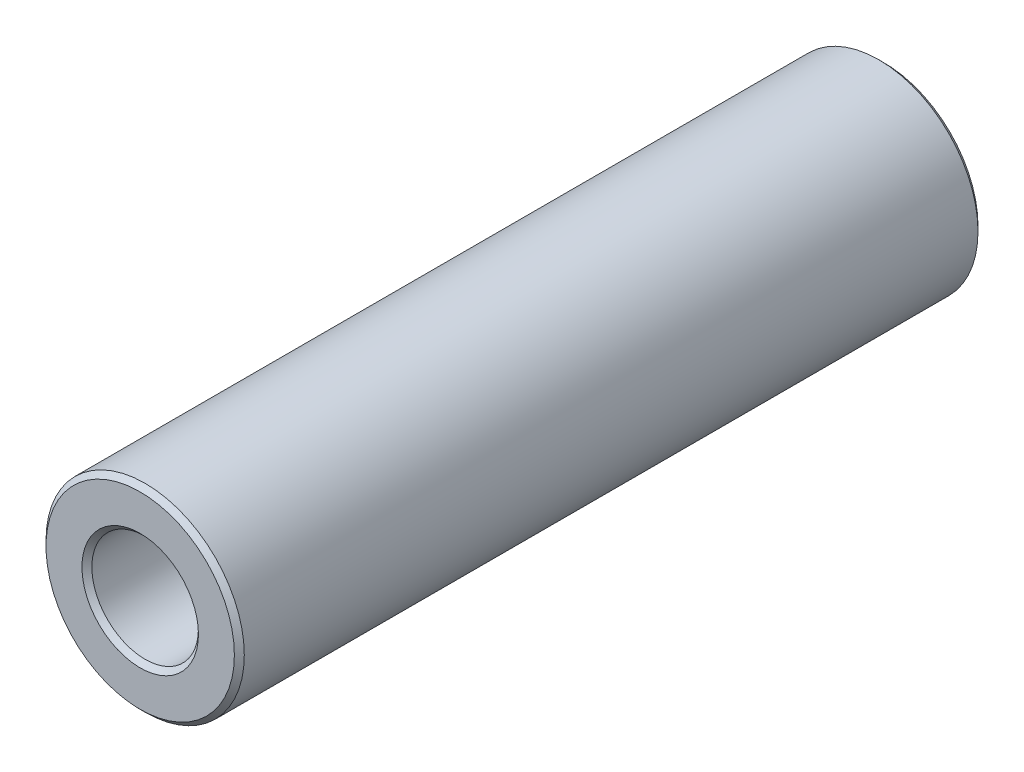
ISO-10303-21;
HEADER;
FILE_DESCRIPTION(('STEP AP214'),'2;1');
FILE_NAME('part.step','',(''),(''),'','','');
FILE_SCHEMA(('AUTOMOTIVE_DESIGN { 1 0 10303 214 1 1 1 1 }'));
ENDSEC;
DATA;
#1=APPLICATION_CONTEXT('core data for automotive mechanical design processes');
#2=APPLICATION_PROTOCOL_DEFINITION('international standard','automotive_design',2000,#1);
#3=PRODUCT_CONTEXT('',#1,'mechanical');
#4=PRODUCT('Part','Part','',(#3));
#5=PRODUCT_RELATED_PRODUCT_CATEGORY('part','',(#4));
#6=PRODUCT_DEFINITION_FORMATION('','',#4);
#7=PRODUCT_DEFINITION_CONTEXT('part definition',#1,'design');
#8=PRODUCT_DEFINITION('design','',#6,#7);
#9=PRODUCT_DEFINITION_SHAPE('','',#8);
#10=(LENGTH_UNIT() NAMED_UNIT(*) SI_UNIT(.MILLI.,.METRE.));
#11=(NAMED_UNIT(*) PLANE_ANGLE_UNIT() SI_UNIT($,.RADIAN.));
#12=(NAMED_UNIT(*) SI_UNIT($,.STERADIAN.) SOLID_ANGLE_UNIT());
#13=UNCERTAINTY_MEASURE_WITH_UNIT(LENGTH_MEASURE(1.E-05),#10,'distance_accuracy_value','');
#14=(GEOMETRIC_REPRESENTATION_CONTEXT(3) GLOBAL_UNCERTAINTY_ASSIGNED_CONTEXT((#13)) GLOBAL_UNIT_ASSIGNED_CONTEXT((#10,
#11,#12)) REPRESENTATION_CONTEXT('',''));
#15=CARTESIAN_POINT('',(0.,0.,0.));
#16=DIRECTION('',(0.,0.,1.));
#17=DIRECTION('',(1.,0.,0.));
#18=AXIS2_PLACEMENT_3D('',#15,#16,#17);
#19=CARTESIAN_POINT('',(0.,0.,15.));
#20=DIRECTION('',(0.,0.,1.));
#21=DIRECTION('',(1.,0.,0.));
#22=AXIS2_PLACEMENT_3D('',#19,#20,#21);
#23=PLANE('',#22);
#24=CARTESIAN_POINT('',(0.,0.,15.));
#25=DIRECTION('',(0.,0.,1.));
#26=DIRECTION('',(1.,0.,0.));
#27=AXIS2_PLACEMENT_3D('',#24,#25,#26);
#28=CIRCLE('',#27,2.35);
#29=CARTESIAN_POINT('',(2.35,0.,15.));
#30=VERTEX_POINT('',#29);
#31=EDGE_CURVE('E10',#30,#30,#28,.F.);
#32=ORIENTED_EDGE('',*,*,#31,.T.);
#33=EDGE_LOOP('',(#32));
#34=FACE_BOUND('',#33,.T.);
#35=CARTESIAN_POINT('',(0.,0.,15.));
#36=DIRECTION('',(0.,0.,1.));
#37=DIRECTION('',(1.,0.,0.));
#38=AXIS2_PLACEMENT_3D('',#35,#36,#37);
#39=CIRCLE('',#38,3.79999999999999);
#40=CARTESIAN_POINT('',(3.79999999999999,0.,15.));
#41=VERTEX_POINT('',#40);
#42=EDGE_CURVE('E45',#41,#41,#39,.T.);
#43=ORIENTED_EDGE('',*,*,#42,.T.);
#44=EDGE_LOOP('',(#43));
#45=FACE_BOUND('',#44,.T.);
#46=ADVANCED_FACE('F37',(#34,#45),#23,.T.);
#47=CARTESIAN_POINT('',(0.,0.,-15.));
#48=DIRECTION('',(0.,0.,1.));
#49=DIRECTION('',(1.,0.,0.));
#50=AXIS2_PLACEMENT_3D('',#47,#48,#49);
#51=PLANE('',#50);
#52=CARTESIAN_POINT('',(0.,0.,-15.));
#53=DIRECTION('',(0.,0.,1.));
#54=DIRECTION('',(1.,0.,0.));
#55=AXIS2_PLACEMENT_3D('',#52,#53,#54);
#56=CIRCLE('',#55,3.79999999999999);
#57=CARTESIAN_POINT('',(3.79999999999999,0.,-15.));
#58=VERTEX_POINT('',#57);
#59=EDGE_CURVE('E62',#58,#58,#56,.F.);
#60=ORIENTED_EDGE('',*,*,#59,.T.);
#61=EDGE_LOOP('',(#60));
#62=FACE_BOUND('',#61,.T.);
#63=CARTESIAN_POINT('',(0.,0.,-15.));
#64=DIRECTION('',(0.,0.,1.));
#65=DIRECTION('',(1.,0.,0.));
#66=AXIS2_PLACEMENT_3D('',#63,#64,#65);
#67=CIRCLE('',#66,2.35);
#68=CARTESIAN_POINT('',(2.35,0.,-15.));
#69=VERTEX_POINT('',#68);
#70=EDGE_CURVE('E66',#69,#69,#67,.T.);
#71=ORIENTED_EDGE('',*,*,#70,.T.);
#72=EDGE_LOOP('',(#71));
#73=FACE_BOUND('',#72,.T.);
#74=ADVANCED_FACE('F89',(#62,#73),#51,.F.);
#75=CARTESIAN_POINT('',(0.,0.,15.));
#76=DIRECTION('',(0.,0.,-1.));
#77=DIRECTION('',(-1.,0.,0.));
#78=AXIS2_PLACEMENT_3D('',#75,#76,#77);
#79=CYLINDRICAL_SURFACE('',#78,4.);
#80=CARTESIAN_POINT('',(0.,0.,-14.8));
#81=DIRECTION('',(0.,0.,1.));
#82=DIRECTION('',(1.,0.,0.));
#83=AXIS2_PLACEMENT_3D('',#80,#81,#82);
#84=CIRCLE('',#83,4.);
#85=CARTESIAN_POINT('',(4.,0.,-14.8));
#86=VERTEX_POINT('',#85);
#87=EDGE_CURVE('E69',#86,#86,#84,.T.);
#88=ORIENTED_EDGE('',*,*,#87,.T.);
#89=EDGE_LOOP('',(#88));
#90=FACE_BOUND('',#89,.T.);
#91=CARTESIAN_POINT('',(0.,0.,14.8));
#92=DIRECTION('',(0.,0.,1.));
#93=DIRECTION('',(1.,0.,0.));
#94=AXIS2_PLACEMENT_3D('',#91,#92,#93);
#95=CIRCLE('',#94,4.);
#96=CARTESIAN_POINT('',(4.,0.,14.8));
#97=VERTEX_POINT('',#96);
#98=EDGE_CURVE('E73',#97,#97,#95,.F.);
#99=ORIENTED_EDGE('',*,*,#98,.T.);
#100=EDGE_LOOP('',(#99));
#101=FACE_BOUND('',#100,.T.);
#102=ADVANCED_FACE('F78',(#90,#101),#79,.T.);
#103=CARTESIAN_POINT('',(0.,0.,15.));
#104=DIRECTION('',(0.,0.,-1.));
#105=DIRECTION('',(-1.,0.,0.));
#106=AXIS2_PLACEMENT_3D('',#103,#104,#105);
#107=CYLINDRICAL_SURFACE('',#106,2.15);
#108=CARTESIAN_POINT('',(0.,0.,-14.8));
#109=DIRECTION('',(0.,0.,1.));
#110=DIRECTION('',(1.,0.,0.));
#111=AXIS2_PLACEMENT_3D('',#108,#109,#110);
#112=CIRCLE('',#111,2.15);
#113=CARTESIAN_POINT('',(2.15,0.,-14.8));
#114=VERTEX_POINT('',#113);
#115=EDGE_CURVE('E50',#114,#114,#112,.F.);
#116=ORIENTED_EDGE('',*,*,#115,.T.);
#117=EDGE_LOOP('',(#116));
#118=FACE_BOUND('',#117,.T.);
#119=CARTESIAN_POINT('',(0.,0.,14.8));
#120=DIRECTION('',(0.,0.,1.));
#121=DIRECTION('',(1.,0.,0.));
#122=AXIS2_PLACEMENT_3D('',#119,#120,#121);
#123=CIRCLE('',#122,2.15);
#124=CARTESIAN_POINT('',(2.15,0.,14.8));
#125=VERTEX_POINT('',#124);
#126=EDGE_CURVE('E56',#125,#125,#123,.T.);
#127=ORIENTED_EDGE('',*,*,#126,.T.);
#128=EDGE_LOOP('',(#127));
#129=FACE_BOUND('',#128,.T.);
#130=ADVANCED_FACE('F97',(#118,#129),#107,.F.);
#131=CARTESIAN_POINT('',(0.,0.,-14.8));
#132=DIRECTION('',(0.,0.,1.));
#133=DIRECTION('',(1.,0.,0.));
#134=AXIS2_PLACEMENT_3D('',#131,#132,#133);
#135=CONICAL_SURFACE('',#134,4.,0.785398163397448);
#136=ORIENTED_EDGE('',*,*,#59,.F.);
#137=EDGE_LOOP('',(#136));
#138=FACE_BOUND('',#137,.T.);
#139=ORIENTED_EDGE('',*,*,#87,.F.);
#140=EDGE_LOOP('',(#139));
#141=FACE_BOUND('',#140,.T.);
#142=ADVANCED_FACE('F102',(#138,#141),#135,.T.);
#143=CARTESIAN_POINT('',(0.,0.,-15.));
#144=DIRECTION('',(0.,0.,-1.));
#145=DIRECTION('',(-1.,0.,0.));
#146=AXIS2_PLACEMENT_3D('',#143,#144,#145);
#147=CONICAL_SURFACE('',#146,2.35,0.785398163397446);
#148=ORIENTED_EDGE('',*,*,#115,.F.);
#149=EDGE_LOOP('',(#148));
#150=FACE_BOUND('',#149,.T.);
#151=ORIENTED_EDGE('',*,*,#70,.F.);
#152=EDGE_LOOP('',(#151));
#153=FACE_BOUND('',#152,.T.);
#154=ADVANCED_FACE('F86',(#150,#153),#147,.F.);
#155=CARTESIAN_POINT('',(0.,0.,14.8));
#156=DIRECTION('',(0.,0.,1.));
#157=DIRECTION('',(1.,0.,0.));
#158=AXIS2_PLACEMENT_3D('',#155,#156,#157);
#159=CONICAL_SURFACE('',#158,2.15,0.785398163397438);
#160=ORIENTED_EDGE('',*,*,#31,.F.);
#161=EDGE_LOOP('',(#160));
#162=FACE_BOUND('',#161,.T.);
#163=ORIENTED_EDGE('',*,*,#126,.F.);
#164=EDGE_LOOP('',(#163));
#165=FACE_BOUND('',#164,.T.);
#166=ADVANCED_FACE('F82',(#162,#165),#159,.F.);
#167=CARTESIAN_POINT('',(0.,0.,15.));
#168=DIRECTION('',(0.,0.,-1.));
#169=DIRECTION('',(-1.,0.,0.));
#170=AXIS2_PLACEMENT_3D('',#167,#168,#169);
#171=CONICAL_SURFACE('',#170,3.79999999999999,0.785398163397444);
#172=ORIENTED_EDGE('',*,*,#98,.F.);
#173=EDGE_LOOP('',(#172));
#174=FACE_BOUND('',#173,.T.);
#175=ORIENTED_EDGE('',*,*,#42,.F.);
#176=EDGE_LOOP('',(#175));
#177=FACE_BOUND('',#176,.T.);
#178=ADVANCED_FACE('F39',(#174,#177),#171,.T.);
#179=CLOSED_SHELL('',(#46,#74,#102,#130,#142,#154,#166,#178));
#180=MANIFOLD_SOLID_BREP('B2',#179);
#181=ADVANCED_BREP_SHAPE_REPRESENTATION('',(#18,#180),#14);
#182=SHAPE_DEFINITION_REPRESENTATION(#9,#181);
ENDSEC;
END-ISO-10303-21;
